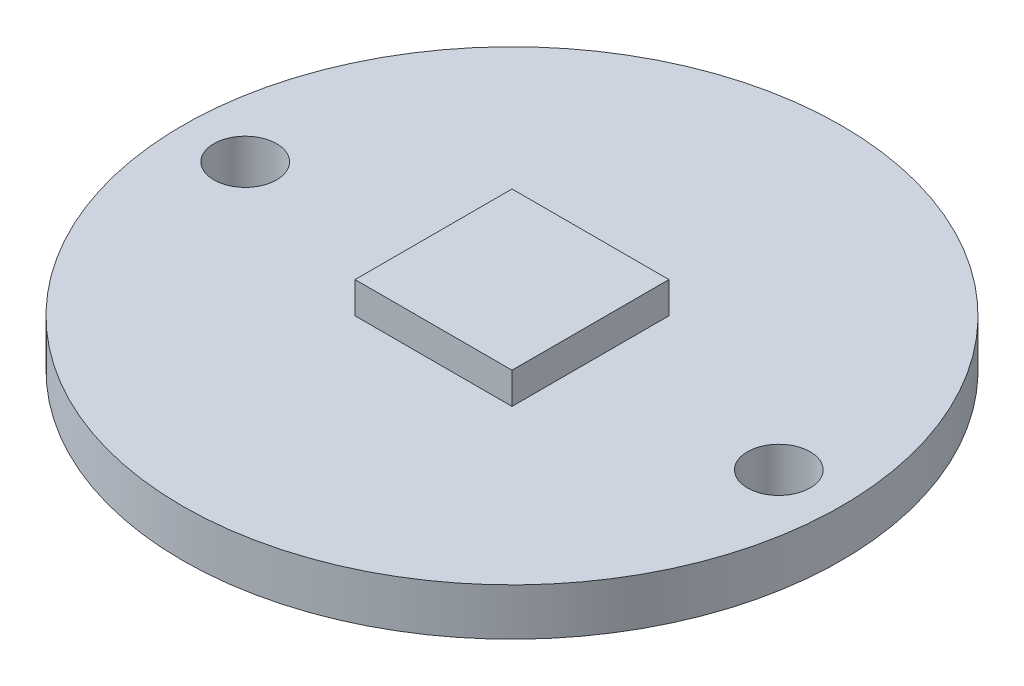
ISO-10303-21;
HEADER;
FILE_DESCRIPTION(('STEP AP214'),'2;1');
FILE_NAME('part.step','',(''),(''),'','','');
FILE_SCHEMA(('AUTOMOTIVE_DESIGN { 1 0 10303 214 1 1 1 1 }'));
ENDSEC;
DATA;
#1=APPLICATION_CONTEXT('core data for automotive mechanical design processes');
#2=APPLICATION_PROTOCOL_DEFINITION('international standard','automotive_design',2000,#1);
#3=PRODUCT_CONTEXT('',#1,'mechanical');
#4=PRODUCT('Part','Part','',(#3));
#5=PRODUCT_RELATED_PRODUCT_CATEGORY('part','',(#4));
#6=PRODUCT_DEFINITION_FORMATION('','',#4);
#7=PRODUCT_DEFINITION_CONTEXT('part definition',#1,'design');
#8=PRODUCT_DEFINITION('design','',#6,#7);
#9=PRODUCT_DEFINITION_SHAPE('','',#8);
#10=(LENGTH_UNIT() NAMED_UNIT(*) SI_UNIT(.MILLI.,.METRE.));
#11=(NAMED_UNIT(*) PLANE_ANGLE_UNIT() SI_UNIT($,.RADIAN.));
#12=(NAMED_UNIT(*) SI_UNIT($,.STERADIAN.) SOLID_ANGLE_UNIT());
#13=UNCERTAINTY_MEASURE_WITH_UNIT(LENGTH_MEASURE(1.E-05),#10,'distance_accuracy_value','');
#14=(GEOMETRIC_REPRESENTATION_CONTEXT(3) GLOBAL_UNCERTAINTY_ASSIGNED_CONTEXT((#13)) GLOBAL_UNIT_ASSIGNED_CONTEXT((#10,
#11,#12)) REPRESENTATION_CONTEXT('',''));
#15=CARTESIAN_POINT('',(0.,0.,0.));
#16=DIRECTION('',(0.,0.,1.));
#17=DIRECTION('',(1.,0.,0.));
#18=AXIS2_PLACEMENT_3D('',#15,#16,#17);
#19=CARTESIAN_POINT('',(0.,1.5,0.));
#20=DIRECTION('',(0.,1.,0.));
#21=DIRECTION('',(0.,0.,1.));
#22=AXIS2_PLACEMENT_3D('',#19,#20,#21);
#23=PLANE('',#22);
#24=CARTESIAN_POINT('',(-8.5,1.5,0.));
#25=DIRECTION('',(0.,1.,0.));
#26=DIRECTION('',(0.,0.,1.));
#27=AXIS2_PLACEMENT_3D('',#24,#25,#26);
#28=CIRCLE('',#27,1.);
#29=CARTESIAN_POINT('',(-8.5,1.5,1.));
#30=VERTEX_POINT('',#29);
#31=EDGE_CURVE('E116',#30,#30,#28,.T.);
#32=ORIENTED_EDGE('',*,*,#31,.F.);
#33=EDGE_LOOP('',(#32));
#34=FACE_BOUND('',#33,.T.);
#35=CARTESIAN_POINT('',(0.,1.5,0.));
#36=DIRECTION('',(0.,1.,0.));
#37=DIRECTION('',(0.,0.,1.));
#38=AXIS2_PLACEMENT_3D('',#35,#36,#37);
#39=CIRCLE('',#38,10.5);
#40=CARTESIAN_POINT('',(0.,1.5,10.5));
#41=VERTEX_POINT('',#40);
#42=EDGE_CURVE('E11',#41,#41,#39,.T.);
#43=ORIENTED_EDGE('',*,*,#42,.T.);
#44=EDGE_LOOP('',(#43));
#45=FACE_BOUND('',#44,.T.);
#46=CARTESIAN_POINT('',(8.5,1.5,0.));
#47=DIRECTION('',(0.,1.,0.));
#48=DIRECTION('',(0.,0.,1.));
#49=AXIS2_PLACEMENT_3D('',#46,#47,#48);
#50=CIRCLE('',#49,1.);
#51=CARTESIAN_POINT('',(8.5,1.5,0.999999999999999));
#52=VERTEX_POINT('',#51);
#53=EDGE_CURVE('E110',#52,#52,#50,.T.);
#54=ORIENTED_EDGE('',*,*,#53,.F.);
#55=EDGE_LOOP('',(#54));
#56=FACE_BOUND('',#55,.T.);
#57=DIRECTION('',(-1.,0.,0.));
#58=VECTOR('',#57,1.);
#59=CARTESIAN_POINT('',(-2.5,1.5,-2.5));
#60=LINE('',#59,#58);
#61=CARTESIAN_POINT('',(2.5,1.5,-2.5));
#62=VERTEX_POINT('',#61);
#63=CARTESIAN_POINT('',(-2.5,1.5,-2.5));
#64=VERTEX_POINT('',#63);
#65=EDGE_CURVE('E88',#62,#64,#60,.T.);
#66=ORIENTED_EDGE('',*,*,#65,.F.);
#67=DIRECTION('',(0.,0.,-1.));
#68=VECTOR('',#67,1.);
#69=CARTESIAN_POINT('',(2.5,1.5,2.5));
#70=LINE('',#69,#68);
#71=CARTESIAN_POINT('',(2.5,1.5,2.5));
#72=VERTEX_POINT('',#71);
#73=EDGE_CURVE('E99',#72,#62,#70,.T.);
#74=ORIENTED_EDGE('',*,*,#73,.F.);
#75=DIRECTION('',(1.,0.,0.));
#76=VECTOR('',#75,1.);
#77=CARTESIAN_POINT('',(-2.5,1.5,2.5));
#78=LINE('',#77,#76);
#79=CARTESIAN_POINT('',(-2.5,1.5,2.5));
#80=VERTEX_POINT('',#79);
#81=EDGE_CURVE('E69',#80,#72,#78,.T.);
#82=ORIENTED_EDGE('',*,*,#81,.F.);
#83=DIRECTION('',(0.,0.,1.));
#84=VECTOR('',#83,1.);
#85=CARTESIAN_POINT('',(-2.5,1.5,2.5));
#86=LINE('',#85,#84);
#87=EDGE_CURVE('E103',#64,#80,#86,.T.);
#88=ORIENTED_EDGE('',*,*,#87,.F.);
#89=EDGE_LOOP('',(#66,#74,#82,#88));
#90=FACE_BOUND('',#89,.T.);
#91=ADVANCED_FACE('F32',(#34,#45,#56,#90),#23,.T.);
#92=CARTESIAN_POINT('',(0.,0.,0.));
#93=DIRECTION('',(0.,1.,0.));
#94=DIRECTION('',(0.,0.,1.));
#95=AXIS2_PLACEMENT_3D('',#92,#93,#94);
#96=PLANE('',#95);
#97=CARTESIAN_POINT('',(0.,0.,0.));
#98=DIRECTION('',(0.,1.,0.));
#99=DIRECTION('',(0.,0.,1.));
#100=AXIS2_PLACEMENT_3D('',#97,#98,#99);
#101=CIRCLE('',#100,10.5);
#102=CARTESIAN_POINT('',(0.,0.,10.5));
#103=VERTEX_POINT('',#102);
#104=EDGE_CURVE('E36',#103,#103,#101,.T.);
#105=ORIENTED_EDGE('',*,*,#104,.F.);
#106=EDGE_LOOP('',(#105));
#107=FACE_BOUND('',#106,.T.);
#108=CARTESIAN_POINT('',(-8.5,0.,0.));
#109=DIRECTION('',(0.,1.,0.));
#110=DIRECTION('',(0.,0.,1.));
#111=AXIS2_PLACEMENT_3D('',#108,#109,#110);
#112=CIRCLE('',#111,1.);
#113=CARTESIAN_POINT('',(-8.5,0.,1.));
#114=VERTEX_POINT('',#113);
#115=EDGE_CURVE('E113',#114,#114,#112,.T.);
#116=ORIENTED_EDGE('',*,*,#115,.T.);
#117=EDGE_LOOP('',(#116));
#118=FACE_BOUND('',#117,.T.);
#119=CARTESIAN_POINT('',(8.5,0.,0.));
#120=DIRECTION('',(0.,1.,0.));
#121=DIRECTION('',(0.,0.,1.));
#122=AXIS2_PLACEMENT_3D('',#119,#120,#121);
#123=CIRCLE('',#122,1.);
#124=CARTESIAN_POINT('',(8.5,0.,0.999999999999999));
#125=VERTEX_POINT('',#124);
#126=EDGE_CURVE('E109',#125,#125,#123,.T.);
#127=ORIENTED_EDGE('',*,*,#126,.T.);
#128=EDGE_LOOP('',(#127));
#129=FACE_BOUND('',#128,.T.);
#130=ADVANCED_FACE('F122',(#107,#118,#129),#96,.F.);
#131=CARTESIAN_POINT('',(0.,1.5,0.));
#132=DIRECTION('',(0.,-1.,0.));
#133=DIRECTION('',(0.,0.,-1.));
#134=AXIS2_PLACEMENT_3D('',#131,#132,#133);
#135=CYLINDRICAL_SURFACE('',#134,10.5);
#136=ORIENTED_EDGE('',*,*,#42,.F.);
#137=EDGE_LOOP('',(#136));
#138=FACE_BOUND('',#137,.T.);
#139=ORIENTED_EDGE('',*,*,#104,.T.);
#140=EDGE_LOOP('',(#139));
#141=FACE_BOUND('',#140,.T.);
#142=ADVANCED_FACE('F34',(#138,#141),#135,.T.);
#143=CARTESIAN_POINT('',(-8.5,1.5,0.));
#144=DIRECTION('',(0.,-1.,0.));
#145=DIRECTION('',(0.,0.,-1.));
#146=AXIS2_PLACEMENT_3D('',#143,#144,#145);
#147=CYLINDRICAL_SURFACE('',#146,1.);
#148=ORIENTED_EDGE('',*,*,#31,.T.);
#149=EDGE_LOOP('',(#148));
#150=FACE_BOUND('',#149,.T.);
#151=ORIENTED_EDGE('',*,*,#115,.F.);
#152=EDGE_LOOP('',(#151));
#153=FACE_BOUND('',#152,.T.);
#154=ADVANCED_FACE('F125',(#150,#153),#147,.F.);
#155=CARTESIAN_POINT('',(8.5,1.5,0.));
#156=DIRECTION('',(0.,-1.,0.));
#157=DIRECTION('',(0.,0.,-1.));
#158=AXIS2_PLACEMENT_3D('',#155,#156,#157);
#159=CYLINDRICAL_SURFACE('',#158,1.);
#160=ORIENTED_EDGE('',*,*,#53,.T.);
#161=EDGE_LOOP('',(#160));
#162=FACE_BOUND('',#161,.T.);
#163=ORIENTED_EDGE('',*,*,#126,.F.);
#164=EDGE_LOOP('',(#163));
#165=FACE_BOUND('',#164,.T.);
#166=ADVANCED_FACE('F127',(#162,#165),#159,.F.);
#167=CARTESIAN_POINT('',(2.5,2.5,2.5));
#168=DIRECTION('',(-1.,0.,0.));
#169=DIRECTION('',(0.,0.,1.));
#170=AXIS2_PLACEMENT_3D('',#167,#168,#169);
#171=PLANE('',#170);
#172=ORIENTED_EDGE('',*,*,#73,.T.);
#173=DIRECTION('',(0.,-1.,0.));
#174=VECTOR('',#173,1.);
#175=CARTESIAN_POINT('',(2.5,2.5,-2.5));
#176=LINE('',#175,#174);
#177=CARTESIAN_POINT('',(2.5,2.5,-2.5));
#178=VERTEX_POINT('',#177);
#179=EDGE_CURVE('E91',#178,#62,#176,.T.);
#180=ORIENTED_EDGE('',*,*,#179,.F.);
#181=DIRECTION('',(0.,0.,-1.));
#182=VECTOR('',#181,1.);
#183=CARTESIAN_POINT('',(2.5,2.5,2.5));
#184=LINE('',#183,#182);
#185=CARTESIAN_POINT('',(2.5,2.5,2.5));
#186=VERTEX_POINT('',#185);
#187=EDGE_CURVE('E81',#186,#178,#184,.T.);
#188=ORIENTED_EDGE('',*,*,#187,.F.);
#189=DIRECTION('',(0.,-1.,0.));
#190=VECTOR('',#189,1.);
#191=CARTESIAN_POINT('',(2.5,2.5,2.5));
#192=LINE('',#191,#190);
#193=EDGE_CURVE('E95',#186,#72,#192,.T.);
#194=ORIENTED_EDGE('',*,*,#193,.T.);
#195=EDGE_LOOP('',(#172,#180,#188,#194));
#196=FACE_BOUND('',#195,.T.);
#197=ADVANCED_FACE('F134',(#196),#171,.F.);
#198=CARTESIAN_POINT('',(-2.5,2.5,-2.5));
#199=DIRECTION('',(0.,0.,1.));
#200=DIRECTION('',(1.,0.,0.));
#201=AXIS2_PLACEMENT_3D('',#198,#199,#200);
#202=PLANE('',#201);
#203=ORIENTED_EDGE('',*,*,#65,.T.);
#204=DIRECTION('',(0.,-1.,0.));
#205=VECTOR('',#204,1.);
#206=CARTESIAN_POINT('',(-2.5,2.5,-2.5));
#207=LINE('',#206,#205);
#208=CARTESIAN_POINT('',(-2.5,2.5,-2.5));
#209=VERTEX_POINT('',#208);
#210=EDGE_CURVE('E85',#209,#64,#207,.T.);
#211=ORIENTED_EDGE('',*,*,#210,.F.);
#212=DIRECTION('',(-1.,0.,0.));
#213=VECTOR('',#212,1.);
#214=CARTESIAN_POINT('',(-2.5,2.5,-2.5));
#215=LINE('',#214,#213);
#216=EDGE_CURVE('E76',#178,#209,#215,.T.);
#217=ORIENTED_EDGE('',*,*,#216,.F.);
#218=ORIENTED_EDGE('',*,*,#179,.T.);
#219=EDGE_LOOP('',(#203,#211,#217,#218));
#220=FACE_BOUND('',#219,.T.);
#221=ADVANCED_FACE('F86',(#220),#202,.F.);
#222=CARTESIAN_POINT('',(-2.5,2.5,2.5));
#223=DIRECTION('',(1.,0.,0.));
#224=DIRECTION('',(0.,0.,-1.));
#225=AXIS2_PLACEMENT_3D('',#222,#223,#224);
#226=PLANE('',#225);
#227=ORIENTED_EDGE('',*,*,#87,.T.);
#228=DIRECTION('',(0.,-1.,0.));
#229=VECTOR('',#228,1.);
#230=CARTESIAN_POINT('',(-2.5,2.5,2.5));
#231=LINE('',#230,#229);
#232=CARTESIAN_POINT('',(-2.5,2.5,2.5));
#233=VERTEX_POINT('',#232);
#234=EDGE_CURVE('E47',#233,#80,#231,.T.);
#235=ORIENTED_EDGE('',*,*,#234,.F.);
#236=DIRECTION('',(0.,0.,1.));
#237=VECTOR('',#236,1.);
#238=CARTESIAN_POINT('',(-2.5,2.5,2.5));
#239=LINE('',#238,#237);
#240=EDGE_CURVE('E79',#209,#233,#239,.T.);
#241=ORIENTED_EDGE('',*,*,#240,.F.);
#242=ORIENTED_EDGE('',*,*,#210,.T.);
#243=EDGE_LOOP('',(#227,#235,#241,#242));
#244=FACE_BOUND('',#243,.T.);
#245=ADVANCED_FACE('F93',(#244),#226,.F.);
#246=CARTESIAN_POINT('',(-2.5,2.5,2.5));
#247=DIRECTION('',(0.,0.,-1.));
#248=DIRECTION('',(-1.,0.,0.));
#249=AXIS2_PLACEMENT_3D('',#246,#247,#248);
#250=PLANE('',#249);
#251=ORIENTED_EDGE('',*,*,#81,.T.);
#252=ORIENTED_EDGE('',*,*,#193,.F.);
#253=DIRECTION('',(1.,0.,0.));
#254=VECTOR('',#253,1.);
#255=CARTESIAN_POINT('',(-2.5,2.5,2.5));
#256=LINE('',#255,#254);
#257=EDGE_CURVE('E55',#233,#186,#256,.T.);
#258=ORIENTED_EDGE('',*,*,#257,.F.);
#259=ORIENTED_EDGE('',*,*,#234,.T.);
#260=EDGE_LOOP('',(#251,#252,#258,#259));
#261=FACE_BOUND('',#260,.T.);
#262=ADVANCED_FACE('F153',(#261),#250,.F.);
#263=CARTESIAN_POINT('',(0.,2.5,0.));
#264=DIRECTION('',(0.,-1.,0.));
#265=DIRECTION('',(0.,0.,-1.));
#266=AXIS2_PLACEMENT_3D('',#263,#264,#265);
#267=PLANE('',#266);
#268=ORIENTED_EDGE('',*,*,#187,.T.);
#269=ORIENTED_EDGE('',*,*,#216,.T.);
#270=ORIENTED_EDGE('',*,*,#240,.T.);
#271=ORIENTED_EDGE('',*,*,#257,.T.);
#272=EDGE_LOOP('',(#268,#269,#270,#271));
#273=FACE_BOUND('',#272,.T.);
#274=ADVANCED_FACE('F77',(#273),#267,.F.);
#275=CLOSED_SHELL('',(#91,#130,#142,#154,#166,#197,#221,#245,#262,#274));
#276=MANIFOLD_SOLID_BREP('B2',#275);
#277=ADVANCED_BREP_SHAPE_REPRESENTATION('',(#18,#276),#14);
#278=SHAPE_DEFINITION_REPRESENTATION(#9,#277);
ENDSEC;
END-ISO-10303-21;
